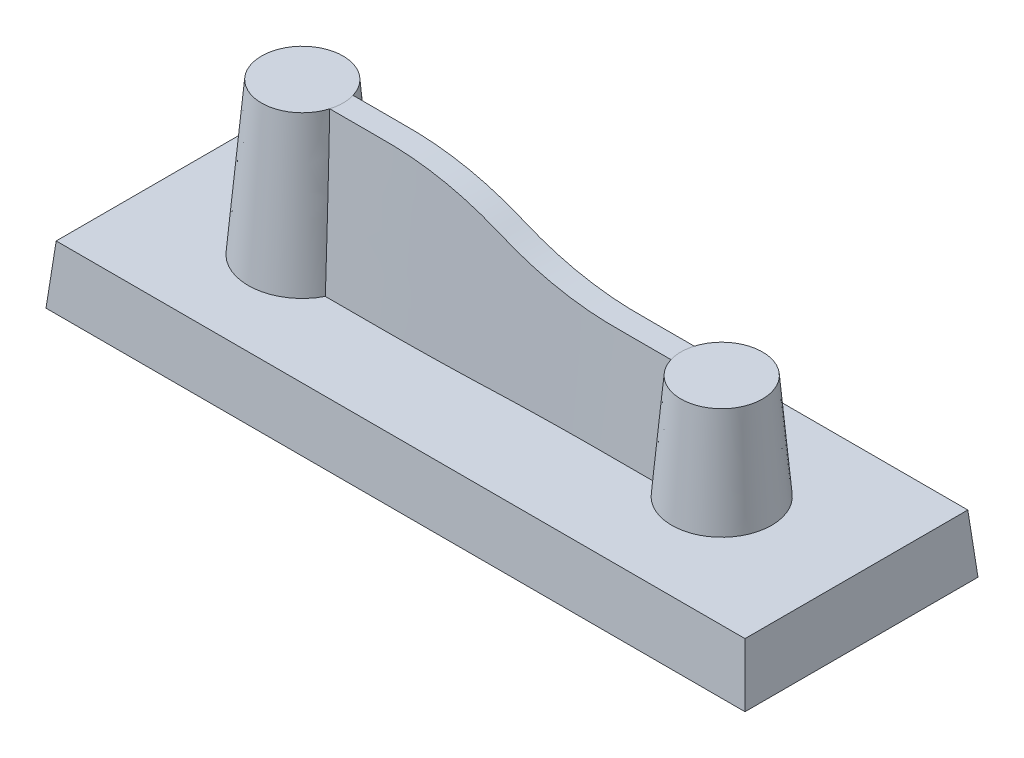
ISO-10303-21;
HEADER;
FILE_DESCRIPTION(('STEP AP214'),'2;1');
FILE_NAME('part.step','',(''),(''),'','','');
FILE_SCHEMA(('AUTOMOTIVE_DESIGN { 1 0 10303 214 1 1 1 1 }'));
ENDSEC;
DATA;
#1=APPLICATION_CONTEXT('core data for automotive mechanical design processes');
#2=APPLICATION_PROTOCOL_DEFINITION('international standard','automotive_design',2000,#1);
#3=PRODUCT_CONTEXT('',#1,'mechanical');
#4=PRODUCT('Part','Part','',(#3));
#5=PRODUCT_RELATED_PRODUCT_CATEGORY('part','',(#4));
#6=PRODUCT_DEFINITION_FORMATION('','',#4);
#7=PRODUCT_DEFINITION_CONTEXT('part definition',#1,'design');
#8=PRODUCT_DEFINITION('design','',#6,#7);
#9=PRODUCT_DEFINITION_SHAPE('','',#8);
#10=(LENGTH_UNIT() NAMED_UNIT(*) SI_UNIT(.MILLI.,.METRE.));
#11=(NAMED_UNIT(*) PLANE_ANGLE_UNIT() SI_UNIT($,.RADIAN.));
#12=(NAMED_UNIT(*) SI_UNIT($,.STERADIAN.) SOLID_ANGLE_UNIT());
#13=UNCERTAINTY_MEASURE_WITH_UNIT(LENGTH_MEASURE(1.E-05),#10,'distance_accuracy_value','');
#14=(GEOMETRIC_REPRESENTATION_CONTEXT(3) GLOBAL_UNCERTAINTY_ASSIGNED_CONTEXT((#13)) GLOBAL_UNIT_ASSIGNED_CONTEXT((#10,
#11,#12)) REPRESENTATION_CONTEXT('',''));
#15=CARTESIAN_POINT('',(0.,0.,0.));
#16=DIRECTION('',(0.,0.,1.));
#17=DIRECTION('',(1.,0.,0.));
#18=AXIS2_PLACEMENT_3D('',#15,#16,#17);
#19=CARTESIAN_POINT('',(150.,0.,-50.));
#20=DIRECTION('',(0.996194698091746,0.0871557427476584,0.));
#21=DIRECTION('',(-0.0871557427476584,0.996194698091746,0.));
#22=AXIS2_PLACEMENT_3D('',#19,#20,#21);
#23=PLANE('',#22);
#24=DIRECTION('',(0.,0.,-1.));
#25=VECTOR('',#24,1.);
#26=CARTESIAN_POINT('',(150.,0.,-50.));
#27=LINE('',#26,#25);
#28=CARTESIAN_POINT('',(150.,0.,50.));
#29=VERTEX_POINT('',#28);
#30=CARTESIAN_POINT('',(150.,0.,-50.));
#31=VERTEX_POINT('',#30);
#32=EDGE_CURVE('E269',#29,#31,#27,.T.);
#33=ORIENTED_EDGE('',*,*,#32,.T.);
#34=DIRECTION('',(0.0868265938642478,-0.992432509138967,-0.0868265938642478));
#35=VECTOR('',#34,1.);
#36=CARTESIAN_POINT('',(147.73834277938,25.8508603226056,-47.7383427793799));
#37=LINE('',#36,#35);
#38=CARTESIAN_POINT('',(147.812783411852,25.,-47.8127834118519));
#39=VERTEX_POINT('',#38);
#40=EDGE_CURVE('E277',#39,#31,#37,.T.);
#41=ORIENTED_EDGE('',*,*,#40,.F.);
#42=DIRECTION('',(0.,0.,1.));
#43=VECTOR('',#42,1.);
#44=CARTESIAN_POINT('',(147.812783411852,25.,-50.));
#45=LINE('',#44,#43);
#46=CARTESIAN_POINT('',(147.812783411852,25.,47.8127834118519));
#47=VERTEX_POINT('',#46);
#48=EDGE_CURVE('E270',#47,#39,#45,.F.);
#49=ORIENTED_EDGE('',*,*,#48,.F.);
#50=DIRECTION('',(0.0868265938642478,-0.992432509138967,0.0868265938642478));
#51=VECTOR('',#50,1.);
#52=CARTESIAN_POINT('',(149.246114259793,8.61695344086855,49.2461142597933));
#53=LINE('',#52,#51);
#54=EDGE_CURVE('E266',#47,#29,#53,.T.);
#55=ORIENTED_EDGE('',*,*,#54,.T.);
#56=EDGE_LOOP('',(#33,#41,#49,#55));
#57=FACE_BOUND('',#56,.T.);
#58=ADVANCED_FACE('F32',(#57),#23,.T.);
#59=CARTESIAN_POINT('',(-150.,0.,-50.));
#60=DIRECTION('',(0.,0.0871557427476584,-0.996194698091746));
#61=DIRECTION('',(0.,0.996194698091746,0.0871557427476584));
#62=AXIS2_PLACEMENT_3D('',#59,#60,#61);
#63=PLANE('',#62);
#64=DIRECTION('',(-1.,0.,0.));
#65=VECTOR('',#64,1.);
#66=CARTESIAN_POINT('',(-150.,0.,-50.));
#67=LINE('',#66,#65);
#68=CARTESIAN_POINT('',(-150.,0.,-50.));
#69=VERTEX_POINT('',#68);
#70=EDGE_CURVE('E261',#31,#69,#67,.T.);
#71=ORIENTED_EDGE('',*,*,#70,.T.);
#72=DIRECTION('',(-0.0868265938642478,-0.992432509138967,-0.0868265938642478));
#73=VECTOR('',#72,1.);
#74=CARTESIAN_POINT('',(-150.,0.,-50.));
#75=LINE('',#74,#73);
#76=CARTESIAN_POINT('',(-147.812783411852,25.,-47.8127834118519));
#77=VERTEX_POINT('',#76);
#78=EDGE_CURVE('E257',#77,#69,#75,.T.);
#79=ORIENTED_EDGE('',*,*,#78,.F.);
#80=DIRECTION('',(1.,0.,0.));
#81=VECTOR('',#80,1.);
#82=CARTESIAN_POINT('',(-150.,25.,-47.8127834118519));
#83=LINE('',#82,#81);
#84=EDGE_CURVE('E273',#39,#77,#83,.F.);
#85=ORIENTED_EDGE('',*,*,#84,.F.);
#86=ORIENTED_EDGE('',*,*,#40,.T.);
#87=EDGE_LOOP('',(#71,#79,#85,#86));
#88=FACE_BOUND('',#87,.T.);
#89=ADVANCED_FACE('F34',(#88),#63,.T.);
#90=CARTESIAN_POINT('',(-150.,0.,-50.));
#91=DIRECTION('',(-0.996194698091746,0.0871557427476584,0.));
#92=DIRECTION('',(-0.0871557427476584,-0.996194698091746,0.));
#93=AXIS2_PLACEMENT_3D('',#90,#91,#92);
#94=PLANE('',#93);
#95=DIRECTION('',(0.,0.,1.));
#96=VECTOR('',#95,1.);
#97=CARTESIAN_POINT('',(-150.,0.,-50.));
#98=LINE('',#97,#96);
#99=CARTESIAN_POINT('',(-150.,0.,50.));
#100=VERTEX_POINT('',#99);
#101=EDGE_CURVE('E251',#69,#100,#98,.T.);
#102=ORIENTED_EDGE('',*,*,#101,.T.);
#103=DIRECTION('',(-0.0868265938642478,-0.992432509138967,0.0868265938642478));
#104=VECTOR('',#103,1.);
#105=CARTESIAN_POINT('',(-150.,0.,50.));
#106=LINE('',#105,#104);
#107=CARTESIAN_POINT('',(-147.812783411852,25.,47.8127834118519));
#108=VERTEX_POINT('',#107);
#109=EDGE_CURVE('E254',#108,#100,#106,.T.);
#110=ORIENTED_EDGE('',*,*,#109,.F.);
#111=DIRECTION('',(0.,0.,-1.));
#112=VECTOR('',#111,1.);
#113=CARTESIAN_POINT('',(-147.812783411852,25.,-50.));
#114=LINE('',#113,#112);
#115=EDGE_CURVE('E283',#77,#108,#114,.F.);
#116=ORIENTED_EDGE('',*,*,#115,.F.);
#117=ORIENTED_EDGE('',*,*,#78,.T.);
#118=EDGE_LOOP('',(#102,#110,#116,#117));
#119=FACE_BOUND('',#118,.T.);
#120=ADVANCED_FACE('F237',(#119),#94,.T.);
#121=CARTESIAN_POINT('',(-150.,0.,50.));
#122=DIRECTION('',(0.,0.0871557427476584,0.996194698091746));
#123=DIRECTION('',(0.,-0.996194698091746,0.0871557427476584));
#124=AXIS2_PLACEMENT_3D('',#121,#122,#123);
#125=PLANE('',#124);
#126=DIRECTION('',(1.,0.,0.));
#127=VECTOR('',#126,1.);
#128=CARTESIAN_POINT('',(-150.,0.,50.));
#129=LINE('',#128,#127);
#130=EDGE_CURVE('E260',#100,#29,#129,.T.);
#131=ORIENTED_EDGE('',*,*,#130,.T.);
#132=ORIENTED_EDGE('',*,*,#54,.F.);
#133=DIRECTION('',(-1.,0.,0.));
#134=VECTOR('',#133,1.);
#135=CARTESIAN_POINT('',(-150.,25.,47.8127834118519));
#136=LINE('',#135,#134);
#137=EDGE_CURVE('E265',#108,#47,#136,.F.);
#138=ORIENTED_EDGE('',*,*,#137,.F.);
#139=ORIENTED_EDGE('',*,*,#109,.T.);
#140=EDGE_LOOP('',(#131,#132,#138,#139));
#141=FACE_BOUND('',#140,.T.);
#142=ADVANCED_FACE('F241',(#141),#125,.T.);
#143=CARTESIAN_POINT('',(0.,25.,0.));
#144=DIRECTION('',(0.,1.,0.));
#145=DIRECTION('',(0.,0.,1.));
#146=AXIS2_PLACEMENT_3D('',#143,#144,#145);
#147=PLANE('',#146);
#148=CARTESIAN_POINT('',(-90.,25.,-10.6867631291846));
#149=CARTESIAN_POINT('',(-82.3982130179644,25.,-10.6867631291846));
#150=CARTESIAN_POINT('',(-74.7964260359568,25.,-10.6867631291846));
#151=CARTESIAN_POINT('',(-63.3937455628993,25.,-10.6867631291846));
#152=CARTESIAN_POINT('',(-59.5928520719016,25.,-10.6867631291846));
#153=CARTESIAN_POINT('',(-53.8915118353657,25.,-10.6867631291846));
#154=CARTESIAN_POINT('',(-51.9910651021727,25.0000012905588,-10.6867631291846));
#155=CARTESIAN_POINT('',(-48.1901715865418,24.9999987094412,-10.6867631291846));
#156=CARTESIAN_POINT('',(-46.2895846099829,24.9852856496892,-10.6867631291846));
#157=CARTESIAN_POINT('',(-36.7920527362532,24.6355662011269,-10.6867631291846));
#158=CARTESIAN_POINT('',(-29.170334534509,23.6548941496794,-10.6867631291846));
#159=CARTESIAN_POINT('',(-17.9889124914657,21.1549886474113,-10.6867631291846));
#160=CARTESIAN_POINT('',(-14.3036206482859,20.1513190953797,-10.6867631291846));
#161=CARTESIAN_POINT('',(-8.87221045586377,18.402689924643,-10.6867631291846));
#162=CARTESIAN_POINT('',(-7.07728970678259,17.7797307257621,-10.6867631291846));
#163=CARTESIAN_POINT('',(-3.51693470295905,16.4477533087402,-10.6867631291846));
#164=CARTESIAN_POINT('',(-1.75687032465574,15.7278432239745,-10.6867631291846));
#165=CARTESIAN_POINT('',(1.75687032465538,14.2721567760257,-10.6867631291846));
#166=CARTESIAN_POINT('',(3.51693470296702,13.5522466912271,-10.6867631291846));
#167=CARTESIAN_POINT('',(7.07728970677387,12.2202692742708,-10.6867631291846));
#168=CARTESIAN_POINT('',(8.87221045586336,11.5973100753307,-10.6867631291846));
#169=CARTESIAN_POINT('',(14.3036206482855,9.84868090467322,-10.6867631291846));
#170=CARTESIAN_POINT('',(17.9889124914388,8.84501135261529,-10.6867631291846));
#171=CARTESIAN_POINT('',(29.1703345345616,6.34510585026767,-10.6867631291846));
#172=CARTESIAN_POINT('',(36.7920527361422,5.36443379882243,-10.6867631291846));
#173=CARTESIAN_POINT('',(46.28958461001,5.01471435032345,-10.6867631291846));
#174=CARTESIAN_POINT('',(48.1901715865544,5.00000129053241,-10.6867631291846));
#175=CARTESIAN_POINT('',(51.991065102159,4.9999987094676,-10.6867631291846));
#176=CARTESIAN_POINT('',(53.8915118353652,5.,-10.6867631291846));
#177=CARTESIAN_POINT('',(59.5928520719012,5.,-10.6867631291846));
#178=CARTESIAN_POINT('',(63.3937455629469,5.,-10.6867631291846));
#179=CARTESIAN_POINT('',(74.7964260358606,5.,-10.6867631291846));
#180=CARTESIAN_POINT('',(82.3982130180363,5.,-10.6867631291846));
#181=CARTESIAN_POINT('',(90.,5.,-10.6867631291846));
#182=B_SPLINE_CURVE_WITH_KNOTS('',3,(#148,#149,#150,#151,#152,#153,#154,#155,#156,#157,#158,
#159,#160,#161,#162,#163,#164,#165,#166,#167,#168,#169,#170,#171,#172,#173,#174,#175,#176,#177,
#178,#179,#180,#181),.UNSPECIFIED.,.F.,.F.,(4,2,2,2,2,2,2,2,2,2,2,2,2,2,2,2,4),(0.,0.125,0.1875,
0.21875,0.25,0.375,0.4375,0.46875,0.5,0.53125,0.5625,0.625,0.75,0.78125,0.8125,0.875,1.),.UNSPECIFIED.);
#183=CARTESIAN_POINT('',(-69.4228505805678,25.,-10.6867631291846));
#184=VERTEX_POINT('',#183);
#185=CARTESIAN_POINT('',(-50.0906183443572,25.,-10.6867631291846));
#186=VERTEX_POINT('',#185);
#187=EDGE_CURVE('E55',#184,#186,#182,.T.);
#188=ORIENTED_EDGE('',*,*,#187,.T.);
#189=CARTESIAN_POINT('',(90.,25.,-8.93698985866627));
#190=CARTESIAN_POINT('',(88.1875759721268,25.,-8.9369898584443));
#191=CARTESIAN_POINT('',(86.3751519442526,25.,-8.93698985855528));
#192=CARTESIAN_POINT('',(82.7501462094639,25.,-8.93698985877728));
#193=CARTESIAN_POINT('',(80.9375645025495,25.,-8.93698985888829));
#194=CARTESIAN_POINT('',(77.3122761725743,25.,-8.93698985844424));
#195=CARTESIAN_POINT('',(75.4995695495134,25.,-8.93698985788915));
#196=CARTESIAN_POINT('',(71.8740641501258,25.,-8.93698985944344));
#197=CARTESIAN_POINT('',(70.0612653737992,25.,-8.93698986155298));
#198=CARTESIAN_POINT('',(66.4356084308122,25.,-8.93698985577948));
#199=CARTESIAN_POINT('',(64.6227502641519,25.,-8.93698984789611));
#200=CARTESIAN_POINT('',(61.9034496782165,25.,-8.93698986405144));
#201=CARTESIAN_POINT('',(60.9970072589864,25.,-8.93698987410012));
#202=CARTESIAN_POINT('',(59.1841224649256,25.,-8.93698984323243));
#203=CARTESIAN_POINT('',(58.2776800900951,25.,-8.93698980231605));
#204=CARTESIAN_POINT('',(56.4650426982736,25.,-8.93698991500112));
#205=CARTESIAN_POINT('',(55.5588476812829,25.,-8.93699006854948));
#206=CARTESIAN_POINT('',(53.746457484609,25.,-8.93698962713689));
#207=CARTESIAN_POINT('',(52.8402623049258,25.,-8.93698903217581));
#208=CARTESIAN_POINT('',(51.4809749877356,25.,-8.93699019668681));
#209=CARTESIAN_POINT('',(51.0278828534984,25.,-8.93699092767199));
#210=CARTESIAN_POINT('',(50.1216985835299,25.,-8.93698874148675));
#211=CARTESIAN_POINT('',(49.6686064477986,25.,-8.93698582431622));
#212=CARTESIAN_POINT('',(48.3093303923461,25.,-8.93730944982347));
#213=CARTESIAN_POINT('',(47.4031464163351,25.,-8.93796836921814));
#214=CARTESIAN_POINT('',(46.0438883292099,25.,-8.94013401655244));
#215=CARTESIAN_POINT('',(45.5908133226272,25.,-8.94105208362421));
#216=CARTESIAN_POINT('',(44.6846646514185,25.,-8.94340703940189));
#217=CARTESIAN_POINT('',(44.2315909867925,25.,-8.94484392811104));
#218=CARTESIAN_POINT('',(42.8723721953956,25.,-8.94980875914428));
#219=CARTESIAN_POINT('',(41.966229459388,25.,-8.95399086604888));
#220=CARTESIAN_POINT('',(39.247885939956,25.,-8.96914104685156));
#221=CARTESIAN_POINT('',(37.435699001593,25.,-8.98271310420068));
#222=CARTESIAN_POINT('',(33.811456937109,25.,-9.01684146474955));
#223=CARTESIAN_POINT('',(31.9994018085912,25.,-9.03739751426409));
#224=CARTESIAN_POINT('',(28.3754473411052,25.,-9.08560669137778));
#225=CARTESIAN_POINT('',(26.5635479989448,25.,-9.11325957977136));
#226=CARTESIAN_POINT('',(22.3611755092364,25.,-9.18589004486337));
#227=CARTESIAN_POINT('',(19.9707482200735,25.,-9.23358008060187));
#228=CARTESIAN_POINT('',(16.3853045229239,25.,-9.31501592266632));
#229=CARTESIAN_POINT('',(15.1901735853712,25.,-9.34381178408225));
#230=CARTESIAN_POINT('',(12.7999973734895,25.,-9.40479346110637));
#231=CARTESIAN_POINT('',(11.6049520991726,25.,-9.43697927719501));
#232=CARTESIAN_POINT('',(9.81243427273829,25.,-9.48785545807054));
#233=CARTESIAN_POINT('',(9.21492458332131,25.,-9.50524747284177));
#234=CARTESIAN_POINT('',(8.01993214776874,25.,-9.54093529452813));
#235=CARTESIAN_POINT('',(7.42244940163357,25.,-9.55923110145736));
#236=CARTESIAN_POINT('',(6.22751212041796,25.,-9.59671359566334));
#237=CARTESIAN_POINT('',(5.63005758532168,25.,-9.61590028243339));
#238=CARTESIAN_POINT('',(4.43518549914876,25.,-9.65538779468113));
#239=CARTESIAN_POINT('',(3.83776794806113,25.,-9.67568861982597));
#240=CARTESIAN_POINT('',(2.64293835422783,25.,-9.71713822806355));
#241=CARTESIAN_POINT('',(2.04552631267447,25.,-9.73828704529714));
#242=CARTESIAN_POINT('',(1.14942064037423,25.,-9.77035871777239));
#243=CARTESIAN_POINT('',(0.850720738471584,25.,-9.781107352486));
#244=CARTESIAN_POINT('',(0.253324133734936,25.,-9.80269328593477));
#245=CARTESIAN_POINT('',(-0.045372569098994,25.,-9.81353058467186));
#246=CARTESIAN_POINT('',(-0.941465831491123,25.,-9.84594603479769));
#247=CARTESIAN_POINT('',(-1.53886589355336,25.,-9.86742775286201));
#248=CARTESIAN_POINT('',(-2.73368774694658,25.,-9.90977319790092));
#249=CARTESIAN_POINT('',(-3.33110953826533,25.,-9.93063692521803));
#250=CARTESIAN_POINT('',(-4.22725851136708,25.,-9.96121684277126));
#251=CARTESIAN_POINT('',(-4.52597347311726,25.,-9.97129073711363));
#252=CARTESIAN_POINT('',(-5.12341307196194,25.,-9.99114743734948));
#253=CARTESIAN_POINT('',(-5.42213770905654,25.,-10.0009302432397));
#254=CARTESIAN_POINT('',(-6.31832318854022,25.,-10.0299236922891));
#255=CARTESIAN_POINT('',(-6.9157955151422,25.,-10.0487793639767));
#256=CARTESIAN_POINT('',(-8.70825645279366,25.,-10.1039785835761));
#257=CARTESIAN_POINT('',(-9.90328739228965,25.,-10.1389542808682));
#258=CARTESIAN_POINT('',(-12.2933992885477,25.,-10.2054578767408));
#259=CARTESIAN_POINT('',(-13.4884802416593,25.,-10.2369859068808));
#260=CARTESIAN_POINT('',(-15.8787251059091,25.,-10.2966713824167));
#261=CARTESIAN_POINT('',(-17.0738890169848,25.,-10.3248288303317));
#262=CARTESIAN_POINT('',(-20.6594302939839,25.,-10.4043642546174));
#263=CARTESIAN_POINT('',(-23.0499187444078,25.,-10.4508070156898));
#264=CARTESIAN_POINT('',(-27.8310650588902,25.,-10.5310045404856));
#265=CARTESIAN_POINT('',(-30.221722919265,25.,-10.5647595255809));
#266=CARTESIAN_POINT('',(-34.2061854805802,25.,-10.6108203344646));
#267=CARTESIAN_POINT('',(-35.7999515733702,25.,-10.6265252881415));
#268=CARTESIAN_POINT('',(-38.1906432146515,25.,-10.646038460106));
#269=CARTESIAN_POINT('',(-38.98755259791,25.,-10.651868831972));
#270=CARTESIAN_POINT('',(-40.581380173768,25.,-10.6621881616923));
#271=CARTESIAN_POINT('',(-41.3782983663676,25.,-10.6666771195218));
#272=CARTESIAN_POINT('',(-42.5736876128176,25.,-10.6723934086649));
#273=CARTESIAN_POINT('',(-42.9721563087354,25.,-10.6741293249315));
#274=CARTESIAN_POINT('',(-43.7690949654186,25.,-10.6772805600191));
#275=CARTESIAN_POINT('',(-44.1675649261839,25.,-10.6786958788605));
#276=CARTESIAN_POINT('',(-45.362976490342,25.,-10.6823370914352));
#277=CARTESIAN_POINT('',(-46.1599199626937,25.,-10.6839582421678));
#278=CARTESIAN_POINT('',(-47.7538246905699,25.,-10.6860569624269));
#279=CARTESIAN_POINT('',(-48.5507859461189,25.,-10.6865345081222));
#280=CARTESIAN_POINT('',(-49.7462279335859,25.,-10.6867672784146));
#281=CARTESIAN_POINT('',(-50.1447086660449,25.,-10.6867642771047));
#282=CARTESIAN_POINT('',(-50.9416701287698,25.,-10.6867620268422));
#283=CARTESIAN_POINT('',(-51.3401508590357,25.,-10.6867627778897));
#284=CARTESIAN_POINT('',(-52.5356026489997,25.,-10.6867639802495));
#285=CARTESIAN_POINT('',(-53.3325737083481,25.,-10.6867633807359));
#286=CARTESIAN_POINT('',(-54.9265157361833,25.,-10.6867629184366));
#287=CARTESIAN_POINT('',(-55.7234867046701,25.,-10.6867630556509));
#288=CARTESIAN_POINT('',(-58.1144077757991,25.,-10.6867632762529));
#289=CARTESIAN_POINT('',(-59.708357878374,25.,-10.6867631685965));
#290=CARTESIAN_POINT('',(-62.8966947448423,25.,-10.6867630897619));
#291=CARTESIAN_POINT('',(-64.4910815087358,25.,-10.6867631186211));
#292=CARTESIAN_POINT('',(-67.6798437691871,25.,-10.686763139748));
#293=CARTESIAN_POINT('',(-69.2742192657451,25.,-10.686763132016));
#294=CARTESIAN_POINT('',(-72.4629462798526,25.,-10.6867631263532));
#295=CARTESIAN_POINT('',(-74.0572977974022,25.,-10.6867631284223));
#296=CARTESIAN_POINT('',(-77.2459641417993,25.,-10.6867631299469));
#297=CARTESIAN_POINT('',(-78.8402789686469,25.,-10.6867631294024));
#298=CARTESIAN_POINT('',(-82.0288592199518,25.,-10.6867631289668));
#299=CARTESIAN_POINT('',(-83.6231246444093,25.,-10.6867631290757));
#300=CARTESIAN_POINT('',(-86.8115933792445,25.,-10.6867631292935));
#301=CARTESIAN_POINT('',(-88.4057966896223,25.,-10.6867631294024));
#302=CARTESIAN_POINT('',(-90.,25.,-10.6867631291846));
#303=B_SPLINE_CURVE_WITH_KNOTS('',3,(#189,#190,#191,#192,#193,#194,#195,#196,#197,#198,#199,
#200,#201,#202,#203,#204,#205,#206,#207,#208,#209,#210,#211,#212,#213,#214,#215,#216,#217,#218,
#219,#220,#221,#222,#223,#224,#225,#226,#227,#228,#229,#230,#231,#232,#233,#234,#235,#236,#237,
#238,#239,#240,#241,#242,#243,#244,#245,#246,#247,#248,#249,#250,#251,#252,#253,#254,#255,#256,
#257,#258,#259,#260,#261,#262,#263,#264,#265,#266,#267,#268,#269,#270,#271,#272,#273,#274,#275,
#276,#277,#278,#279,#280,#281,#282,#283,#284,#285,#286,#287,#288,#289,#290,#291,#292,#293,#294,
#295,#296,#297,#298,#299,#300,#301,#302),.UNSPECIFIED.,.F.,.F.,(4,2,2,2,2,2,2,2,2,2,2,2,2,2,2,2,
2,2,2,2,2,2,2,2,2,2,2,2,2,2,2,2,2,2,2,2,2,2,2,2,2,2,2,2,2,2,2,2,2,2,2,2,2,2,2,2,4),(0.,
5.43727208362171,10.8750172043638,16.3131370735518,21.7515334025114,27.1901079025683,
29.9094351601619,32.6287622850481,35.3473473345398,38.0659328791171,39.4252092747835,
40.7844857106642,43.5030373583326,44.8622649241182,46.2214924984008,48.9399482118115,
54.3766471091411,59.8131485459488,65.2494667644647,72.4221352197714,76.0085649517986,
79.5949951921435,81.3882829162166,83.1815706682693,84.9748574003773,86.7681435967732,
88.5615020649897,89.4581817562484,90.3548614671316,92.1482198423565,93.9415772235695,
94.838231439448,95.7348856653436,97.5281943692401,101.114816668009,104.701302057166,
108.287784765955,115.460565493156,122.63322106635,127.41474236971,129.805533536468,
132.196324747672,133.391742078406,134.587159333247,136.977993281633,139.368877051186,
140.564319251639,141.759761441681,144.150674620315,146.541587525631,151.323437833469,
156.106598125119,160.889724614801,165.672779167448,170.455723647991,175.238519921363,
180.021129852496),.UNSPECIFIED.);
#304=CARTESIAN_POINT('',(70.5147556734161,25.,-8.93698985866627));
#305=VERTEX_POINT('',#304);
#306=EDGE_CURVE('E209',#305,#186,#303,.T.);
#307=ORIENTED_EDGE('',*,*,#306,.F.);
#308=CARTESIAN_POINT('',(90.,25.,0.));
#309=DIRECTION('',(0.,1.,0.));
#310=DIRECTION('',(0.,0.,1.));
#311=AXIS2_PLACEMENT_3D('',#308,#309,#310);
#312=CIRCLE('',#311,21.4369898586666);
#313=CARTESIAN_POINT('',(70.5147556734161,25.,8.93698985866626));
#314=VERTEX_POINT('',#313);
#315=EDGE_CURVE('E11',#314,#305,#312,.T.);
#316=ORIENTED_EDGE('',*,*,#315,.F.);
#317=CARTESIAN_POINT('',(-90.,25.,10.6867631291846));
#318=CARTESIAN_POINT('',(-88.1875759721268,25.,10.6867631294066));
#319=CARTESIAN_POINT('',(-86.3751519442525,25.,10.6867631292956));
#320=CARTESIAN_POINT('',(-82.7501462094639,25.,10.6867631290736));
#321=CARTESIAN_POINT('',(-80.9375645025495,25.,10.6867631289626));
#322=CARTESIAN_POINT('',(-77.3122761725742,25.,10.6867631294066));
#323=CARTESIAN_POINT('',(-75.4995695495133,25.,10.6867631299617));
#324=CARTESIAN_POINT('',(-71.8740641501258,25.,10.6867631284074));
#325=CARTESIAN_POINT('',(-70.0612653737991,25.,10.6867631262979));
#326=CARTESIAN_POINT('',(-66.4356084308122,25.,10.6867631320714));
#327=CARTESIAN_POINT('',(-64.6227502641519,25.,10.6867631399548));
#328=CARTESIAN_POINT('',(-61.9034496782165,25.,10.6867631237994));
#329=CARTESIAN_POINT('',(-60.9970072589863,25.,10.6867631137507));
#330=CARTESIAN_POINT('',(-59.1841224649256,25.,10.6867631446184));
#331=CARTESIAN_POINT('',(-58.277680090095,25.,10.6867631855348));
#332=CARTESIAN_POINT('',(-56.4650426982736,25.,10.6867630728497));
#333=CARTESIAN_POINT('',(-55.5588476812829,25.,10.6867629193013));
#334=CARTESIAN_POINT('',(-53.7464574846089,25.,10.6867633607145));
#335=CARTESIAN_POINT('',(-52.8402623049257,25.,10.6867639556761));
#336=CARTESIAN_POINT('',(-51.4809749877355,25.,10.6867627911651));
#337=CARTESIAN_POINT('',(-51.0278828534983,25.,10.6867620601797));
#338=CARTESIAN_POINT('',(-50.1216985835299,25.,10.6867642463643));
#339=CARTESIAN_POINT('',(-49.6686064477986,25.,10.6867671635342));
#340=CARTESIAN_POINT('',(-48.309330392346,25.,10.6864435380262));
#341=CARTESIAN_POINT('',(-47.4031464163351,25.,10.6857846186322));
#342=CARTESIAN_POINT('',(-46.0438883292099,25.,10.6836189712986));
#343=CARTESIAN_POINT('',(-45.5908133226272,25.,10.682700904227));
#344=CARTESIAN_POINT('',(-44.6846646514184,25.,10.6803459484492));
#345=CARTESIAN_POINT('',(-44.2315909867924,25.,10.6789090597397));
#346=CARTESIAN_POINT('',(-42.8723721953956,25.,10.6739442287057));
#347=CARTESIAN_POINT('',(-41.966229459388,25.,10.6697621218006));
#348=CARTESIAN_POINT('',(-39.247885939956,25.,10.6546119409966));
#349=CARTESIAN_POINT('',(-37.435699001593,25.,10.6410398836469));
#350=CARTESIAN_POINT('',(-33.811456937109,25.,10.6069115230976));
#351=CARTESIAN_POINT('',(-31.9994018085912,25.,10.5863554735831));
#352=CARTESIAN_POINT('',(-28.3754473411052,25.,10.5381462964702));
#353=CARTESIAN_POINT('',(-26.5635479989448,25.,10.5104934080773));
#354=CARTESIAN_POINT('',(-22.3611755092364,25.,10.4378629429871));
#355=CARTESIAN_POINT('',(-19.9707482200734,25.,10.3901729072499));
#356=CARTESIAN_POINT('',(-16.3853045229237,25.,10.308737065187));
#357=CARTESIAN_POINT('',(-15.190173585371,25.,10.2799412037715));
#358=CARTESIAN_POINT('',(-12.7999973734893,25.,10.2189595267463));
#359=CARTESIAN_POINT('',(-11.6049520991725,25.,10.1867737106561));
#360=CARTESIAN_POINT('',(-9.81243427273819,25.,10.1358975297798));
#361=CARTESIAN_POINT('',(-9.2149245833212,25.,10.1185055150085));
#362=CARTESIAN_POINT('',(-8.01993214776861,25.,10.0828176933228));
#363=CARTESIAN_POINT('',(-7.42244940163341,25.,10.0645218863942));
#364=CARTESIAN_POINT('',(-6.2275121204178,25.,10.0270393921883));
#365=CARTESIAN_POINT('',(-5.63005758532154,25.,10.0078527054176));
#366=CARTESIAN_POINT('',(-4.43518549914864,25.,9.96836519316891));
#367=CARTESIAN_POINT('',(-3.83776794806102,25.,9.94806436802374));
#368=CARTESIAN_POINT('',(-2.6429383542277,25.,9.90661475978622));
#369=CARTESIAN_POINT('',(-2.04552631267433,25.,9.88546594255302));
#370=CARTESIAN_POINT('',(-1.14942064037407,25.,9.8533942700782));
#371=CARTESIAN_POINT('',(-0.850720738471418,25.,9.84264563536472));
#372=CARTESIAN_POINT('',(-0.253324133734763,25.,9.8210597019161));
#373=CARTESIAN_POINT('',(0.0453725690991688,25.,9.81022240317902));
#374=CARTESIAN_POINT('',(0.941465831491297,25.,9.77780695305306));
#375=CARTESIAN_POINT('',(1.53886589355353,25.,9.75632523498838));
#376=CARTESIAN_POINT('',(2.73368774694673,25.,9.71397978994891));
#377=CARTESIAN_POINT('',(3.33110953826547,25.,9.6931160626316));
#378=CARTESIAN_POINT('',(4.22725851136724,25.,9.66253614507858));
#379=CARTESIAN_POINT('',(4.52597347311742,25.,9.65246225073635));
#380=CARTESIAN_POINT('',(5.12341307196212,25.,9.63260555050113));
#381=CARTESIAN_POINT('',(5.42213770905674,25.,9.62282274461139));
#382=CARTESIAN_POINT('',(6.31832318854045,25.,9.59382929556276));
#383=CARTESIAN_POINT('',(6.91579551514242,25.,9.57497362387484));
#384=CARTESIAN_POINT('',(8.70825645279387,25.,9.51977440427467));
#385=CARTESIAN_POINT('',(9.90328739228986,25.,9.48479870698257));
#386=CARTESIAN_POINT('',(12.293399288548,25.,9.41829511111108));
#387=CARTESIAN_POINT('',(13.4884802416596,25.,9.38676708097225));
#388=CARTESIAN_POINT('',(15.8787251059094,25.,9.32708160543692));
#389=CARTESIAN_POINT('',(17.0738890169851,25.,9.29892415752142));
#390=CARTESIAN_POINT('',(20.6594302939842,25.,9.21938873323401));
#391=CARTESIAN_POINT('',(23.049918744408,25.,9.17294597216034));
#392=CARTESIAN_POINT('',(27.8310650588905,25.,9.09274844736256));
#393=CARTESIAN_POINT('',(30.2217229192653,25.,9.05899346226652));
#394=CARTESIAN_POINT('',(34.2061854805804,25.,9.01293265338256));
#395=CARTESIAN_POINT('',(35.7999515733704,25.,8.99722769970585));
#396=CARTESIAN_POINT('',(38.1906432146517,25.,8.9777145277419));
#397=CARTESIAN_POINT('',(38.9875525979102,25.,8.97188415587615));
#398=CARTESIAN_POINT('',(40.5813801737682,25.,8.96156482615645));
#399=CARTESIAN_POINT('',(41.3782983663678,25.,8.95707586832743));
#400=CARTESIAN_POINT('',(42.5736876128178,25.,8.95135957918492));
#401=CARTESIAN_POINT('',(42.9721563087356,25.,8.94962366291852));
#402=CARTESIAN_POINT('',(43.7690949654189,25.,8.94647242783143));
#403=CARTESIAN_POINT('',(44.1675649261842,25.,8.94505710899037));
#404=CARTESIAN_POINT('',(45.3629764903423,25.,8.94141589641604));
#405=CARTESIAN_POINT('',(46.1599199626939,25.,8.93979474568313));
#406=CARTESIAN_POINT('',(47.7538246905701,25.,8.93769602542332));
#407=CARTESIAN_POINT('',(48.5507859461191,25.,8.93721847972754));
#408=CARTESIAN_POINT('',(49.7462279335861,25.,8.9369857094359));
#409=CARTESIAN_POINT('',(50.1447086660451,25.,8.93698871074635));
#410=CARTESIAN_POINT('',(50.94167012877,25.,8.93699096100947));
#411=CARTESIAN_POINT('',(51.3401508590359,25.,8.93699020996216));
#412=CARTESIAN_POINT('',(52.5356026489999,25.,8.93698900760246));
#413=CARTESIAN_POINT('',(53.3325737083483,25.,8.93698960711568));
#414=CARTESIAN_POINT('',(54.9265157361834,25.,8.93699006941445));
#415=CARTESIAN_POINT('',(55.7234867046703,25.,8.93698993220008));
#416=CARTESIAN_POINT('',(58.1144077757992,25.,8.93698971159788));
#417=CARTESIAN_POINT('',(59.7083578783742,25.,8.93698981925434));
#418=CARTESIAN_POINT('',(62.8966947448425,25.,8.93698989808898));
#419=CARTESIAN_POINT('',(64.4910815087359,25.,8.93698986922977));
#420=CARTESIAN_POINT('',(67.6798437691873,25.,8.93698984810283));
#421=CARTESIAN_POINT('',(69.2742192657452,25.,8.93698985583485));
#422=CARTESIAN_POINT('',(72.4629462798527,25.,8.93698986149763));
#423=CARTESIAN_POINT('',(74.0572977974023,25.,8.93698985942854));
#424=CARTESIAN_POINT('',(77.2459641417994,25.,8.93698985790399));
#425=CARTESIAN_POINT('',(78.8402789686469,25.,8.93698985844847));
#426=CARTESIAN_POINT('',(82.0288592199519,25.,8.93698985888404));
#427=CARTESIAN_POINT('',(83.6231246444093,25.,8.93698985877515));
#428=CARTESIAN_POINT('',(86.8115933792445,25.,8.93698985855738));
#429=CARTESIAN_POINT('',(88.4057966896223,25.,8.9369898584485));
#430=CARTESIAN_POINT('',(90.,25.,8.93698985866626));
#431=B_SPLINE_CURVE_WITH_KNOTS('',3,(#317,#318,#319,#320,#321,#322,#323,#324,#325,#326,#327,
#328,#329,#330,#331,#332,#333,#334,#335,#336,#337,#338,#339,#340,#341,#342,#343,#344,#345,#346,
#347,#348,#349,#350,#351,#352,#353,#354,#355,#356,#357,#358,#359,#360,#361,#362,#363,#364,#365,
#366,#367,#368,#369,#370,#371,#372,#373,#374,#375,#376,#377,#378,#379,#380,#381,#382,#383,#384,
#385,#386,#387,#388,#389,#390,#391,#392,#393,#394,#395,#396,#397,#398,#399,#400,#401,#402,#403,
#404,#405,#406,#407,#408,#409,#410,#411,#412,#413,#414,#415,#416,#417,#418,#419,#420,#421,#422,
#423,#424,#425,#426,#427,#428,#429,#430),.UNSPECIFIED.,.F.,.F.,(4,2,2,2,2,2,2,2,2,2,2,2,2,2,2,2,
2,2,2,2,2,2,2,2,2,2,2,2,2,2,2,2,2,2,2,2,2,2,2,2,2,2,2,2,2,2,2,2,2,2,2,2,2,2,2,2,4),(0.,
5.43727208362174,10.8750172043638,16.3131370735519,21.7515334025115,27.1901079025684,
29.909435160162,32.6287622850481,35.3473473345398,38.0659328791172,39.4252092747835,
40.7844857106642,43.5030373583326,44.8622649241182,46.2214924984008,48.9399482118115,
54.3766471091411,59.8131485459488,65.2494667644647,72.4221352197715,76.0085649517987,
79.5949951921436,81.3882829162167,83.1815706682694,84.9748574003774,86.7681435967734,
88.5615020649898,89.4581817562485,90.3548614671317,92.1482198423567,93.9415772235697,
94.8382314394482,95.7348856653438,97.5281943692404,101.114816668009,104.701302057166,
108.287784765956,115.460565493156,122.63322106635,127.414742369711,129.805533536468,
132.196324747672,133.391742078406,134.587159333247,136.977993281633,139.368877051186,
140.564319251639,141.759761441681,144.150674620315,146.541587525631,151.323437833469,
156.106598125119,160.889724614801,165.672779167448,170.455723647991,175.238519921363,
180.021129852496),.UNSPECIFIED.);
#432=CARTESIAN_POINT('',(-50.0906183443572,25.,10.6867631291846));
#433=VERTEX_POINT('',#432);
#434=EDGE_CURVE('E48',#433,#314,#431,.T.);
#435=ORIENTED_EDGE('',*,*,#434,.F.);
#436=CARTESIAN_POINT('',(-90.,25.,10.6867631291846));
#437=CARTESIAN_POINT('',(-82.3982130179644,25.,10.6867631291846));
#438=CARTESIAN_POINT('',(-74.7964260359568,25.,10.6867631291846));
#439=CARTESIAN_POINT('',(-63.3937455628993,25.,10.6867631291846));
#440=CARTESIAN_POINT('',(-59.5928520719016,25.,10.6867631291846));
#441=CARTESIAN_POINT('',(-53.8915118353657,25.,10.6867631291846));
#442=CARTESIAN_POINT('',(-51.9910651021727,25.0000012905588,10.6867631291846));
#443=CARTESIAN_POINT('',(-48.1901715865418,24.9999987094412,10.6867631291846));
#444=CARTESIAN_POINT('',(-46.2895846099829,24.9852856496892,10.6867631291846));
#445=CARTESIAN_POINT('',(-36.7920527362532,24.6355662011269,10.6867631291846));
#446=CARTESIAN_POINT('',(-29.170334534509,23.6548941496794,10.6867631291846));
#447=CARTESIAN_POINT('',(-17.9889124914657,21.1549886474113,10.6867631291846));
#448=CARTESIAN_POINT('',(-14.3036206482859,20.1513190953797,10.6867631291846));
#449=CARTESIAN_POINT('',(-8.87221045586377,18.402689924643,10.6867631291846));
#450=CARTESIAN_POINT('',(-7.07728970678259,17.7797307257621,10.6867631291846));
#451=CARTESIAN_POINT('',(-3.51693470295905,16.4477533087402,10.6867631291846));
#452=CARTESIAN_POINT('',(-1.75687032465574,15.7278432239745,10.6867631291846));
#453=CARTESIAN_POINT('',(1.75687032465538,14.2721567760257,10.6867631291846));
#454=CARTESIAN_POINT('',(3.51693470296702,13.5522466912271,10.6867631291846));
#455=CARTESIAN_POINT('',(7.07728970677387,12.2202692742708,10.6867631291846));
#456=CARTESIAN_POINT('',(8.87221045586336,11.5973100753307,10.6867631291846));
#457=CARTESIAN_POINT('',(14.3036206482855,9.84868090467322,10.6867631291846));
#458=CARTESIAN_POINT('',(17.9889124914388,8.84501135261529,10.6867631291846));
#459=CARTESIAN_POINT('',(29.1703345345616,6.34510585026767,10.6867631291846));
#460=CARTESIAN_POINT('',(36.7920527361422,5.36443379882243,10.6867631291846));
#461=CARTESIAN_POINT('',(46.28958461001,5.01471435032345,10.6867631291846));
#462=CARTESIAN_POINT('',(48.1901715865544,5.00000129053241,10.6867631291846));
#463=CARTESIAN_POINT('',(51.991065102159,4.9999987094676,10.6867631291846));
#464=CARTESIAN_POINT('',(53.8915118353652,5.,10.6867631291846));
#465=CARTESIAN_POINT('',(59.5928520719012,5.,10.6867631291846));
#466=CARTESIAN_POINT('',(63.3937455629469,5.,10.6867631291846));
#467=CARTESIAN_POINT('',(74.7964260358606,5.,10.6867631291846));
#468=CARTESIAN_POINT('',(82.3982130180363,5.,10.6867631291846));
#469=CARTESIAN_POINT('',(90.,5.,10.6867631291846));
#470=B_SPLINE_CURVE_WITH_KNOTS('',3,(#436,#437,#438,#439,#440,#441,#442,#443,#444,#445,#446,
#447,#448,#449,#450,#451,#452,#453,#454,#455,#456,#457,#458,#459,#460,#461,#462,#463,#464,#465,
#466,#467,#468,#469),.UNSPECIFIED.,.F.,.F.,(4,2,2,2,2,2,2,2,2,2,2,2,2,2,2,2,4),(0.,0.125,0.1875,
0.21875,0.25,0.375,0.4375,0.46875,0.5,0.53125,0.5625,0.625,0.75,0.78125,0.8125,0.875,1.),.UNSPECIFIED.);
#471=CARTESIAN_POINT('',(-69.4228505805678,25.,10.6867631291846));
#472=VERTEX_POINT('',#471);
#473=EDGE_CURVE('E127',#472,#433,#470,.T.);
#474=ORIENTED_EDGE('',*,*,#473,.F.);
#475=CARTESIAN_POINT('',(-90.,25.,0.));
#476=DIRECTION('',(0.,1.,0.));
#477=DIRECTION('',(0.,0.,1.));
#478=AXIS2_PLACEMENT_3D('',#475,#476,#477);
#479=CIRCLE('',#478,23.1867631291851);
#480=EDGE_CURVE('E36',#184,#472,#479,.T.);
#481=ORIENTED_EDGE('',*,*,#480,.F.);
#482=EDGE_LOOP('',(#188,#307,#316,#435,#474,#481));
#483=FACE_BOUND('',#482,.T.);
#484=ORIENTED_EDGE('',*,*,#48,.T.);
#485=ORIENTED_EDGE('',*,*,#84,.T.);
#486=ORIENTED_EDGE('',*,*,#115,.T.);
#487=ORIENTED_EDGE('',*,*,#137,.T.);
#488=EDGE_LOOP('',(#484,#485,#486,#487));
#489=FACE_BOUND('',#488,.T.);
#490=ADVANCED_FACE('F199',(#483,#489),#147,.T.);
#491=CARTESIAN_POINT('',(0.,0.,0.));
#492=DIRECTION('',(0.,1.,0.));
#493=DIRECTION('',(0.,0.,1.));
#494=AXIS2_PLACEMENT_3D('',#491,#492,#493);
#495=PLANE('',#494);
#496=ORIENTED_EDGE('',*,*,#32,.F.);
#497=ORIENTED_EDGE('',*,*,#130,.F.);
#498=ORIENTED_EDGE('',*,*,#101,.F.);
#499=ORIENTED_EDGE('',*,*,#70,.F.);
#500=EDGE_LOOP('',(#496,#497,#498,#499));
#501=FACE_BOUND('',#500,.T.);
#502=ADVANCED_FACE('F197',(#501),#495,.F.);
#503=CARTESIAN_POINT('',(-90.,90.,0.));
#504=DIRECTION('',(0.,-1.,0.));
#505=DIRECTION('',(0.,0.,1.));
#506=AXIS2_PLACEMENT_3D('',#503,#504,#505);
#507=CONICAL_SURFACE('',#506,17.5,0.0872664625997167);
#508=CARTESIAN_POINT('',(-69.4228505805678,25.,-10.6867631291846));
#509=CARTESIAN_POINT('',(-69.6107989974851,28.5361748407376,-10.3773879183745));
#510=CARTESIAN_POINT('',(-69.8012912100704,32.0722163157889,-10.06802437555));
#511=CARTESIAN_POINT('',(-70.1878679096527,39.1440010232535,-9.44932338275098));
#512=CARTESIAN_POINT('',(-70.3839524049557,42.6797442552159,-9.13998593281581));
#513=CARTESIAN_POINT('',(-70.7886384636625,49.8648884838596,-8.51136726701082));
#514=CARTESIAN_POINT('',(-70.9974397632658,53.5142783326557,-8.19208702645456));
#515=CARTESIAN_POINT('',(-71.4222129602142,60.8126413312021,-7.55356300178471));
#516=CARTESIAN_POINT('',(-71.6381848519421,64.4616144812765,-7.23431921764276));
#517=CARTESIAN_POINT('',(-72.0780813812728,71.7591509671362,-6.59586750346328));
#518=CARTESIAN_POINT('',(-72.3020061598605,75.4077142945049,-6.27665957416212));
#519=CARTESIAN_POINT('',(-72.7587956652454,82.7042912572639,-5.63829180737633));
#520=CARTESIAN_POINT('',(-72.9916604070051,86.3523048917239,-5.3191319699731));
#521=CARTESIAN_POINT('',(-73.2294901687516,90.,-5.));
#522=B_SPLINE_CURVE_WITH_KNOTS('',3,(#508,#509,#510,#511,#512,#513,#514,#515,#516,#517,#518,
#519,#520,#521),.UNSPECIFIED.,.F.,.F.,(4,2,2,2,2,2,4),(0.,10.663964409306,21.3279446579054,
32.3357652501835,43.3435772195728,54.3515844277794,65.3596100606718),.UNSPECIFIED.);
#523=CARTESIAN_POINT('',(-73.2294901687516,90.,-5.));
#524=VERTEX_POINT('',#523);
#525=EDGE_CURVE('E121',#184,#524,#522,.T.);
#526=ORIENTED_EDGE('',*,*,#525,.F.);
#527=ORIENTED_EDGE('',*,*,#480,.T.);
#528=CARTESIAN_POINT('',(-73.2294901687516,90.,5.));
#529=CARTESIAN_POINT('',(-73.0555833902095,87.3329602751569,5.23333574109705));
#530=CARTESIAN_POINT('',(-72.8843479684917,84.6657485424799,5.46668653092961));
#531=CARTESIAN_POINT('',(-72.546806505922,79.3310167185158,5.93341508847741));
#532=CARTESIAN_POINT('',(-72.3805004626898,76.6634966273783,6.16679285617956));
#533=CARTESIAN_POINT('',(-72.0524047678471,71.3281894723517,6.6335717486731));
#534=CARTESIAN_POINT('',(-71.8906151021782,68.6604024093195,6.86697287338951));
#535=CARTESIAN_POINT('',(-71.571206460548,63.3245805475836,7.33379679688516));
#536=CARTESIAN_POINT('',(-71.4135874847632,60.6565457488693,7.56721959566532));
#537=CARTESIAN_POINT('',(-71.0975182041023,55.2397947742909,8.04112389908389));
#538=CARTESIAN_POINT('',(-70.9391861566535,52.4910717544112,8.28160600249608));
#539=CARTESIAN_POINT('',(-70.6263273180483,46.9934099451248,8.76258908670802));
#540=CARTESIAN_POINT('',(-70.4718005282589,44.2444711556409,9.00309006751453));
#541=CARTESIAN_POINT('',(-70.1662883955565,38.7463789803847,9.48411080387));
#542=CARTESIAN_POINT('',(-70.0153030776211,35.997225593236,9.72463055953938));
#543=CARTESIAN_POINT('',(-69.7166474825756,30.4987418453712,10.205685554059));
#544=CARTESIAN_POINT('',(-69.5689772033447,27.7494114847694,10.4462207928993));
#545=CARTESIAN_POINT('',(-69.4228505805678,25.,10.6867631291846));
#546=B_SPLINE_CURVE_WITH_KNOTS('',3,(#528,#529,#530,#531,#532,#533,#534,#535,#536,#537,#538,
#539,#540,#541,#542,#543,#544,#545),.UNSPECIFIED.,.F.,.F.,(4,2,2,2,2,2,2,2,4),(0.,
8.04860662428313,16.0972093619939,24.1457870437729,32.1943650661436,40.4856474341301,
48.7769327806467,57.0682765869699,65.3596150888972),.UNSPECIFIED.);
#547=CARTESIAN_POINT('',(-73.2294901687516,90.,5.));
#548=VERTEX_POINT('',#547);
#549=EDGE_CURVE('E181',#548,#472,#546,.T.);
#550=ORIENTED_EDGE('',*,*,#549,.F.);
#551=CARTESIAN_POINT('',(-90.,90.,0.));
#552=DIRECTION('',(0.,1.,0.));
#553=DIRECTION('',(0.,0.,1.));
#554=AXIS2_PLACEMENT_3D('',#551,#552,#553);
#555=CIRCLE('',#554,17.5);
#556=EDGE_CURVE('E113',#524,#548,#555,.T.);
#557=ORIENTED_EDGE('',*,*,#556,.F.);
#558=EDGE_LOOP('',(#526,#527,#550,#557));
#559=FACE_BOUND('',#558,.T.);
#560=ADVANCED_FACE('F193',(#559),#507,.T.);
#561=CARTESIAN_POINT('',(-90.,90.,0.));
#562=DIRECTION('',(0.,1.,0.));
#563=DIRECTION('',(0.,0.,1.));
#564=AXIS2_PLACEMENT_3D('',#561,#562,#563);
#565=PLANE('',#564);
#566=EDGE_CURVE('E132',#548,#524,#555,.T.);
#567=ORIENTED_EDGE('',*,*,#566,.T.);
#568=ORIENTED_EDGE('',*,*,#556,.T.);
#569=EDGE_LOOP('',(#567,#568));
#570=FACE_BOUND('',#569,.T.);
#571=ADVANCED_FACE('F196',(#570),#565,.T.);
#572=CARTESIAN_POINT('',(90.,70.,0.));
#573=DIRECTION('',(0.,-1.,0.));
#574=DIRECTION('',(0.,0.,1.));
#575=AXIS2_PLACEMENT_3D('',#572,#573,#574);
#576=CONICAL_SURFACE('',#575,17.5,0.0872664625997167);
#577=CARTESIAN_POINT('',(73.2294901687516,70.,-5.00000000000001));
#578=CARTESIAN_POINT('',(73.0555830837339,67.3329556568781,-5.23333614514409));
#579=CARTESIAN_POINT('',(72.8843473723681,64.6657392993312,-5.46668733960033));
#580=CARTESIAN_POINT('',(72.5468053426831,59.3309981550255,-5.93341671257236));
#581=CARTESIAN_POINT('',(72.3804990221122,56.6634733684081,-6.16679489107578));
#582=CARTESIAN_POINT('',(72.0524033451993,51.3281661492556,-6.63357378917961));
#583=CARTESIAN_POINT('',(71.8906139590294,48.6603837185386,-6.86697450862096));
#584=CARTESIAN_POINT('',(71.5712059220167,43.3245711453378,-7.33379761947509));
#585=CARTESIAN_POINT('',(71.4135872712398,40.6565410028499,-7.56722001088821));
#586=CARTESIAN_POINT('',(71.1315955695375,35.8238087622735,-7.99002929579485));
#587=CARTESIAN_POINT('',(71.0065622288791,33.6591448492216,-8.17941284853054));
#588=CARTESIAN_POINT('',(70.7588949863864,29.3296748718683,-8.55819239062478));
#589=CARTESIAN_POINT('',(70.63626109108,27.1648688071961,-8.74758838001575));
#590=CARTESIAN_POINT('',(70.5147556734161,25.,-8.93698985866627));
#591=B_SPLINE_CURVE_WITH_KNOTS('',3,(#577,#578,#579,#580,#581,#582,#583,#584,#585,#586,#587,
#588,#589,#590),.UNSPECIFIED.,.F.,.F.,(4,2,2,2,2,2,4),(0.,8.04862057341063,16.0972374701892,
24.1458012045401,32.1943650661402,38.7239444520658,45.2535416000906),.UNSPECIFIED.);
#592=CARTESIAN_POINT('',(73.2294901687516,70.,-5.));
#593=VERTEX_POINT('',#592);
#594=EDGE_CURVE('E120',#593,#305,#591,.T.);
#595=ORIENTED_EDGE('',*,*,#594,.F.);
#596=CARTESIAN_POINT('',(90.,70.,0.));
#597=DIRECTION('',(0.,1.,0.));
#598=DIRECTION('',(0.,0.,1.));
#599=AXIS2_PLACEMENT_3D('',#596,#597,#598);
#600=CIRCLE('',#599,17.5);
#601=CARTESIAN_POINT('',(73.2294901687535,70.,5.));
#602=VERTEX_POINT('',#601);
#603=EDGE_CURVE('E108',#602,#593,#600,.T.);
#604=ORIENTED_EDGE('',*,*,#603,.F.);
#605=CARTESIAN_POINT('',(70.5147556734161,25.,8.93698985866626));
#606=CARTESIAN_POINT('',(70.6982293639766,28.2688040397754,8.65100656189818));
#607=CARTESIAN_POINT('',(70.8842619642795,31.5374659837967,8.36503569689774));
#608=CARTESIAN_POINT('',(71.2619672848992,38.074452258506,7.79312350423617));
#609=CARTESIAN_POINT('',(71.4536399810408,41.342776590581,7.5071821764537));
#610=CARTESIAN_POINT('',(71.9005987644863,48.8431102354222,6.85098800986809));
#611=CARTESIAN_POINT('',(72.1579713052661,53.0749966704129,6.48074592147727));
#612=CARTESIAN_POINT('',(72.552850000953,59.4222928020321,5.92542946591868));
#613=CARTESIAN_POINT('',(72.6859466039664,61.537975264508,5.74033123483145));
#614=CARTESIAN_POINT('',(72.9552965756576,65.7691413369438,5.37015216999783));
#615=CARTESIAN_POINT('',(73.0915499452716,67.8846249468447,5.18507133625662));
#616=CARTESIAN_POINT('',(73.2294901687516,70.,5.));
#617=B_SPLINE_CURVE_WITH_KNOTS('',3,(#605,#606,#607,#608,#609,#610,#611,#612,#613,#614,#615,
#616),.UNSPECIFIED.,.F.,.F.,(4,2,2,2,2,4),(0.,9.85924682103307,19.7184513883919,
32.4859579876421,38.8697475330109,45.2535389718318),.UNSPECIFIED.);
#618=EDGE_CURVE('E118',#314,#602,#617,.T.);
#619=ORIENTED_EDGE('',*,*,#618,.F.);
#620=ORIENTED_EDGE('',*,*,#315,.T.);
#621=EDGE_LOOP('',(#595,#604,#619,#620));
#622=FACE_BOUND('',#621,.T.);
#623=ADVANCED_FACE('F117',(#622),#576,.T.);
#624=CARTESIAN_POINT('',(90.,70.,0.));
#625=DIRECTION('',(0.,1.,0.));
#626=DIRECTION('',(0.,0.,1.));
#627=AXIS2_PLACEMENT_3D('',#624,#625,#626);
#628=PLANE('',#627);
#629=ORIENTED_EDGE('',*,*,#603,.T.);
#630=EDGE_CURVE('E105',#593,#602,#600,.T.);
#631=ORIENTED_EDGE('',*,*,#630,.T.);
#632=EDGE_LOOP('',(#629,#631));
#633=FACE_BOUND('',#632,.T.);
#634=ADVANCED_FACE('F107',(#633),#628,.T.);
#635=CARTESIAN_POINT('',(-90.,25.,-10.6867631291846));
#636=CARTESIAN_POINT('',(-82.3982130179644,25.,-10.6867631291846));
#637=CARTESIAN_POINT('',(-74.7964260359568,25.,-10.6867631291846));
#638=CARTESIAN_POINT('',(-63.3937455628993,25.,-10.6867631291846));
#639=CARTESIAN_POINT('',(-59.5928520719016,25.,-10.6867631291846));
#640=CARTESIAN_POINT('',(-53.8915118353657,25.,-10.6867631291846));
#641=CARTESIAN_POINT('',(-51.9910651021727,25.0000012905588,-10.6867631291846));
#642=CARTESIAN_POINT('',(-48.1901715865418,24.9999987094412,-10.6867631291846));
#643=CARTESIAN_POINT('',(-46.2895846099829,24.9852856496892,-10.6867631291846));
#644=CARTESIAN_POINT('',(-36.7920527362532,24.6355662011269,-10.6867631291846));
#645=CARTESIAN_POINT('',(-29.170334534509,23.6548941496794,-10.6867631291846));
#646=CARTESIAN_POINT('',(-17.9889124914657,21.1549886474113,-10.6867631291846));
#647=CARTESIAN_POINT('',(-14.3036206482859,20.1513190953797,-10.6867631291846));
#648=CARTESIAN_POINT('',(-8.87221045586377,18.402689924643,-10.6867631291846));
#649=CARTESIAN_POINT('',(-7.07728970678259,17.7797307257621,-10.6867631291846));
#650=CARTESIAN_POINT('',(-3.51693470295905,16.4477533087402,-10.6867631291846));
#651=CARTESIAN_POINT('',(-1.75687032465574,15.7278432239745,-10.6867631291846));
#652=CARTESIAN_POINT('',(1.75687032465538,14.2721567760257,-10.6867631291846));
#653=CARTESIAN_POINT('',(3.51693470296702,13.5522466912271,-10.6867631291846));
#654=CARTESIAN_POINT('',(7.07728970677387,12.2202692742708,-10.6867631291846));
#655=CARTESIAN_POINT('',(8.87221045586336,11.5973100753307,-10.6867631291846));
#656=CARTESIAN_POINT('',(14.3036206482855,9.84868090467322,-10.6867631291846));
#657=CARTESIAN_POINT('',(17.9889124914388,8.84501135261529,-10.6867631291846));
#658=CARTESIAN_POINT('',(29.1703345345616,6.34510585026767,-10.6867631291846));
#659=CARTESIAN_POINT('',(36.7920527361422,5.36443379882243,-10.6867631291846));
#660=CARTESIAN_POINT('',(46.28958461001,5.01471435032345,-10.6867631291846));
#661=CARTESIAN_POINT('',(48.1901715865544,5.00000129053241,-10.6867631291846));
#662=CARTESIAN_POINT('',(51.991065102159,4.9999987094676,-10.6867631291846));
#663=CARTESIAN_POINT('',(53.8915118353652,5.,-10.6867631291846));
#664=CARTESIAN_POINT('',(59.5928520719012,5.,-10.6867631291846));
#665=CARTESIAN_POINT('',(63.3937455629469,5.,-10.6867631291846));
#666=CARTESIAN_POINT('',(74.7964260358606,5.,-10.6867631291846));
#667=CARTESIAN_POINT('',(82.3982130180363,5.,-10.6867631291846));
#668=CARTESIAN_POINT('',(90.,5.,-10.6867631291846));
#669=CARTESIAN_POINT('',(-90.,90.,-5.));
#670=CARTESIAN_POINT('',(-82.3982130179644,90.,-5.));
#671=CARTESIAN_POINT('',(-74.7964260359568,90.,-5.));
#672=CARTESIAN_POINT('',(-63.3937455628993,90.,-5.));
#673=CARTESIAN_POINT('',(-59.5928520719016,90.,-5.));
#674=CARTESIAN_POINT('',(-53.8915118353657,90.,-5.));
#675=CARTESIAN_POINT('',(-51.9910651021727,90.0000012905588,-5.));
#676=CARTESIAN_POINT('',(-48.1901715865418,89.9999987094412,-5.));
#677=CARTESIAN_POINT('',(-46.2895846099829,89.9852856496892,-5.));
#678=CARTESIAN_POINT('',(-36.7920527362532,89.6355662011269,-5.));
#679=CARTESIAN_POINT('',(-29.170334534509,88.6548941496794,-5.));
#680=CARTESIAN_POINT('',(-17.9889124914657,86.1549886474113,-5.));
#681=CARTESIAN_POINT('',(-14.3036206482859,85.1513190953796,-5.));
#682=CARTESIAN_POINT('',(-8.87221045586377,83.4026899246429,-5.));
#683=CARTESIAN_POINT('',(-7.07728970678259,82.7797307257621,-5.));
#684=CARTESIAN_POINT('',(-3.51693470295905,81.4477533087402,-5.));
#685=CARTESIAN_POINT('',(-1.75687032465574,80.7278432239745,-5.));
#686=CARTESIAN_POINT('',(1.75687032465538,79.2721567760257,-5.));
#687=CARTESIAN_POINT('',(3.51693470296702,78.5522466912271,-5.));
#688=CARTESIAN_POINT('',(7.07728970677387,77.2202692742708,-5.));
#689=CARTESIAN_POINT('',(8.87221045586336,76.5973100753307,-5.));
#690=CARTESIAN_POINT('',(14.3036206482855,74.8486809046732,-5.));
#691=CARTESIAN_POINT('',(17.9889124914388,73.8450113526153,-5.));
#692=CARTESIAN_POINT('',(29.1703345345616,71.3451058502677,-5.));
#693=CARTESIAN_POINT('',(36.7920527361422,70.3644337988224,-5.));
#694=CARTESIAN_POINT('',(46.28958461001,70.0147143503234,-5.));
#695=CARTESIAN_POINT('',(48.1901715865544,70.0000012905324,-5.));
#696=CARTESIAN_POINT('',(51.991065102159,69.9999987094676,-5.));
#697=CARTESIAN_POINT('',(53.8915118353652,70.,-5.));
#698=CARTESIAN_POINT('',(59.5928520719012,70.,-5.));
#699=CARTESIAN_POINT('',(63.3937455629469,70.,-5.));
#700=CARTESIAN_POINT('',(74.7964260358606,70.,-5.));
#701=CARTESIAN_POINT('',(82.3982130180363,70.,-5.));
#702=CARTESIAN_POINT('',(90.,70.,-5.));
#703=B_SPLINE_SURFACE_WITH_KNOTS('',1,3,((#635,#636,#637,#638,#639,#640,#641,#642,#643,#644,
#645,#646,#647,#648,#649,#650,#651,#652,#653,#654,#655,#656,#657,#658,#659,#660,#661,#662,#663,
#664,#665,#666,#667,#668),(#669,#670,#671,#672,#673,#674,#675,#676,#677,#678,#679,#680,#681,
#682,#683,#684,#685,#686,#687,#688,#689,#690,#691,#692,#693,#694,#695,#696,#697,#698,#699,#700,
#701,#702)),.UNSPECIFIED.,.F.,.F.,.F.,(2,2),(4,2,2,2,2,2,2,2,2,2,2,2,2,2,2,2,4),(0.,1.),(0.,
0.125,0.1875,0.21875,0.25,0.375,0.4375,0.46875,0.5,0.53125,0.5625,0.625,0.75,0.78125,0.8125,
0.875,1.),.UNSPECIFIED.);
#704=CARTESIAN_POINT('',(-90.,90.,-5.));
#705=CARTESIAN_POINT('',(-82.3982130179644,90.,-5.));
#706=CARTESIAN_POINT('',(-74.7964260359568,90.,-5.));
#707=CARTESIAN_POINT('',(-63.3937455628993,90.,-5.));
#708=CARTESIAN_POINT('',(-59.5928520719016,90.,-5.));
#709=CARTESIAN_POINT('',(-53.8915118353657,90.,-5.));
#710=CARTESIAN_POINT('',(-51.9910651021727,90.0000012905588,-5.));
#711=CARTESIAN_POINT('',(-48.1901715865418,89.9999987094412,-5.));
#712=CARTESIAN_POINT('',(-46.2895846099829,89.9852856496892,-5.));
#713=CARTESIAN_POINT('',(-36.7920527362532,89.6355662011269,-5.));
#714=CARTESIAN_POINT('',(-29.170334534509,88.6548941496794,-5.));
#715=CARTESIAN_POINT('',(-17.9889124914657,86.1549886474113,-5.));
#716=CARTESIAN_POINT('',(-14.3036206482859,85.1513190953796,-5.));
#717=CARTESIAN_POINT('',(-8.87221045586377,83.4026899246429,-5.));
#718=CARTESIAN_POINT('',(-7.07728970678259,82.7797307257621,-5.));
#719=CARTESIAN_POINT('',(-3.51693470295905,81.4477533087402,-5.));
#720=CARTESIAN_POINT('',(-1.75687032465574,80.7278432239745,-5.));
#721=CARTESIAN_POINT('',(1.75687032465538,79.2721567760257,-5.));
#722=CARTESIAN_POINT('',(3.51693470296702,78.5522466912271,-5.));
#723=CARTESIAN_POINT('',(7.07728970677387,77.2202692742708,-5.));
#724=CARTESIAN_POINT('',(8.87221045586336,76.5973100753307,-5.));
#725=CARTESIAN_POINT('',(14.3036206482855,74.8486809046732,-5.));
#726=CARTESIAN_POINT('',(17.9889124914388,73.8450113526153,-5.));
#727=CARTESIAN_POINT('',(29.1703345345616,71.3451058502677,-5.));
#728=CARTESIAN_POINT('',(36.7920527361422,70.3644337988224,-5.));
#729=CARTESIAN_POINT('',(46.28958461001,70.0147143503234,-5.));
#730=CARTESIAN_POINT('',(48.1901715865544,70.0000012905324,-5.));
#731=CARTESIAN_POINT('',(51.991065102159,69.9999987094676,-5.));
#732=CARTESIAN_POINT('',(53.8915118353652,70.,-5.));
#733=CARTESIAN_POINT('',(59.5928520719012,70.,-5.));
#734=CARTESIAN_POINT('',(63.3937455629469,70.,-5.));
#735=CARTESIAN_POINT('',(74.7964260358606,70.,-5.));
#736=CARTESIAN_POINT('',(82.3982130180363,70.,-5.));
#737=CARTESIAN_POINT('',(90.,70.,-5.));
#738=B_SPLINE_CURVE_WITH_KNOTS('',3,(#704,#705,#706,#707,#708,#709,#710,#711,#712,#713,#714,
#715,#716,#717,#718,#719,#720,#721,#722,#723,#724,#725,#726,#727,#728,#729,#730,#731,#732,#733,
#734,#735,#736,#737),.UNSPECIFIED.,.F.,.F.,(4,2,2,2,2,2,2,2,2,2,2,2,2,2,2,2,4),(0.,0.125,0.1875,
0.21875,0.25,0.375,0.4375,0.46875,0.5,0.53125,0.5625,0.625,0.75,0.78125,0.8125,0.875,1.),.UNSPECIFIED.);
#739=EDGE_CURVE('E133',#524,#593,#738,.T.);
#740=ORIENTED_EDGE('',*,*,#187,.F.);
#741=ORIENTED_EDGE('',*,*,#525,.T.);
#742=ORIENTED_EDGE('',*,*,#739,.T.);
#743=ORIENTED_EDGE('',*,*,#594,.T.);
#744=ORIENTED_EDGE('',*,*,#306,.T.);
#745=EDGE_LOOP('',(#740,#741,#742,#743,#744));
#746=FACE_BOUND('',#745,.T.);
#747=ADVANCED_FACE('F214',(#746),#703,.T.);
#748=CARTESIAN_POINT('',(-90.,90.,-5.));
#749=CARTESIAN_POINT('',(-82.3982130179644,90.,-5.));
#750=CARTESIAN_POINT('',(-74.7964260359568,90.,-5.));
#751=CARTESIAN_POINT('',(-63.3937455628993,90.,-5.));
#752=CARTESIAN_POINT('',(-59.5928520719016,90.,-5.));
#753=CARTESIAN_POINT('',(-53.8915118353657,90.,-5.));
#754=CARTESIAN_POINT('',(-51.9910651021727,90.0000012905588,-5.));
#755=CARTESIAN_POINT('',(-48.1901715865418,89.9999987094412,-5.));
#756=CARTESIAN_POINT('',(-46.2895846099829,89.9852856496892,-5.));
#757=CARTESIAN_POINT('',(-36.7920527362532,89.6355662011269,-5.));
#758=CARTESIAN_POINT('',(-29.170334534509,88.6548941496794,-5.));
#759=CARTESIAN_POINT('',(-17.9889124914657,86.1549886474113,-5.));
#760=CARTESIAN_POINT('',(-14.3036206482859,85.1513190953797,-5.));
#761=CARTESIAN_POINT('',(-8.87221045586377,83.402689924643,-5.));
#762=CARTESIAN_POINT('',(-7.07728970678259,82.7797307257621,-5.));
#763=CARTESIAN_POINT('',(-3.51693470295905,81.4477533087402,-5.));
#764=CARTESIAN_POINT('',(-1.75687032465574,80.7278432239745,-5.));
#765=CARTESIAN_POINT('',(1.75687032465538,79.2721567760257,-5.));
#766=CARTESIAN_POINT('',(3.51693470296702,78.5522466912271,-5.));
#767=CARTESIAN_POINT('',(7.07728970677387,77.2202692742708,-5.));
#768=CARTESIAN_POINT('',(8.87221045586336,76.5973100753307,-5.));
#769=CARTESIAN_POINT('',(14.3036206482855,74.8486809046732,-5.));
#770=CARTESIAN_POINT('',(17.9889124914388,73.8450113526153,-5.));
#771=CARTESIAN_POINT('',(29.1703345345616,71.3451058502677,-5.));
#772=CARTESIAN_POINT('',(36.7920527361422,70.3644337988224,-5.));
#773=CARTESIAN_POINT('',(46.28958461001,70.0147143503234,-5.));
#774=CARTESIAN_POINT('',(48.1901715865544,70.0000012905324,-5.));
#775=CARTESIAN_POINT('',(51.991065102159,69.9999987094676,-5.));
#776=CARTESIAN_POINT('',(53.8915118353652,70.,-5.));
#777=CARTESIAN_POINT('',(59.5928520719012,70.,-5.));
#778=CARTESIAN_POINT('',(63.3937455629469,70.,-5.));
#779=CARTESIAN_POINT('',(74.7964260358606,70.,-5.));
#780=CARTESIAN_POINT('',(82.3982130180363,70.,-5.));
#781=CARTESIAN_POINT('',(90.,70.,-5.));
#782=CARTESIAN_POINT('',(-90.,90.,5.));
#783=CARTESIAN_POINT('',(-82.3982130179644,90.,5.));
#784=CARTESIAN_POINT('',(-74.7964260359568,90.,5.));
#785=CARTESIAN_POINT('',(-63.3937455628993,90.,5.));
#786=CARTESIAN_POINT('',(-59.5928520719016,90.,5.));
#787=CARTESIAN_POINT('',(-53.8915118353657,90.,5.));
#788=CARTESIAN_POINT('',(-51.9910651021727,90.0000012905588,5.));
#789=CARTESIAN_POINT('',(-48.1901715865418,89.9999987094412,5.));
#790=CARTESIAN_POINT('',(-46.2895846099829,89.9852856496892,5.));
#791=CARTESIAN_POINT('',(-36.7920527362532,89.6355662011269,5.));
#792=CARTESIAN_POINT('',(-29.170334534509,88.6548941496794,5.));
#793=CARTESIAN_POINT('',(-17.9889124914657,86.1549886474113,5.));
#794=CARTESIAN_POINT('',(-14.3036206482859,85.1513190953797,5.));
#795=CARTESIAN_POINT('',(-8.87221045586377,83.402689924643,5.));
#796=CARTESIAN_POINT('',(-7.07728970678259,82.7797307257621,5.));
#797=CARTESIAN_POINT('',(-3.51693470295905,81.4477533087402,5.));
#798=CARTESIAN_POINT('',(-1.75687032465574,80.7278432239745,5.));
#799=CARTESIAN_POINT('',(1.75687032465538,79.2721567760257,5.));
#800=CARTESIAN_POINT('',(3.51693470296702,78.5522466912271,5.));
#801=CARTESIAN_POINT('',(7.07728970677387,77.2202692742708,5.));
#802=CARTESIAN_POINT('',(8.87221045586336,76.5973100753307,5.));
#803=CARTESIAN_POINT('',(14.3036206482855,74.8486809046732,5.));
#804=CARTESIAN_POINT('',(17.9889124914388,73.8450113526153,5.));
#805=CARTESIAN_POINT('',(29.1703345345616,71.3451058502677,5.));
#806=CARTESIAN_POINT('',(36.7920527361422,70.3644337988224,5.));
#807=CARTESIAN_POINT('',(46.28958461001,70.0147143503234,5.));
#808=CARTESIAN_POINT('',(48.1901715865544,70.0000012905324,5.));
#809=CARTESIAN_POINT('',(51.991065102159,69.9999987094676,5.));
#810=CARTESIAN_POINT('',(53.8915118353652,70.,5.));
#811=CARTESIAN_POINT('',(59.5928520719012,70.,5.));
#812=CARTESIAN_POINT('',(63.3937455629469,70.,5.));
#813=CARTESIAN_POINT('',(74.7964260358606,70.,5.));
#814=CARTESIAN_POINT('',(82.3982130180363,70.,5.));
#815=CARTESIAN_POINT('',(90.,70.,5.));
#816=B_SPLINE_SURFACE_WITH_KNOTS('',1,3,((#748,#749,#750,#751,#752,#753,#754,#755,#756,#757,
#758,#759,#760,#761,#762,#763,#764,#765,#766,#767,#768,#769,#770,#771,#772,#773,#774,#775,#776,
#777,#778,#779,#780,#781),(#782,#783,#784,#785,#786,#787,#788,#789,#790,#791,#792,#793,#794,
#795,#796,#797,#798,#799,#800,#801,#802,#803,#804,#805,#806,#807,#808,#809,#810,#811,#812,#813,
#814,#815)),.UNSPECIFIED.,.F.,.F.,.F.,(2,2),(4,2,2,2,2,2,2,2,2,2,2,2,2,2,2,2,4),(0.,1.),(0.,
0.125,0.1875,0.21875,0.25,0.375,0.4375,0.46875,0.5,0.53125,0.5625,0.625,0.75,0.78125,0.8125,
0.875,1.),.UNSPECIFIED.);
#817=CARTESIAN_POINT('',(-90.,90.,5.));
#818=CARTESIAN_POINT('',(-82.3982130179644,90.,5.));
#819=CARTESIAN_POINT('',(-74.7964260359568,90.,5.));
#820=CARTESIAN_POINT('',(-63.3937455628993,90.,5.));
#821=CARTESIAN_POINT('',(-59.5928520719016,90.,5.));
#822=CARTESIAN_POINT('',(-53.8915118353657,90.,5.));
#823=CARTESIAN_POINT('',(-51.9910651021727,90.0000012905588,5.));
#824=CARTESIAN_POINT('',(-48.1901715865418,89.9999987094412,5.));
#825=CARTESIAN_POINT('',(-46.2895846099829,89.9852856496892,5.));
#826=CARTESIAN_POINT('',(-36.7920527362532,89.6355662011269,5.));
#827=CARTESIAN_POINT('',(-29.170334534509,88.6548941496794,5.));
#828=CARTESIAN_POINT('',(-17.9889124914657,86.1549886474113,5.));
#829=CARTESIAN_POINT('',(-14.3036206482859,85.1513190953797,5.));
#830=CARTESIAN_POINT('',(-8.87221045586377,83.402689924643,5.));
#831=CARTESIAN_POINT('',(-7.07728970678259,82.7797307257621,5.));
#832=CARTESIAN_POINT('',(-3.51693470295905,81.4477533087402,5.));
#833=CARTESIAN_POINT('',(-1.75687032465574,80.7278432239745,5.));
#834=CARTESIAN_POINT('',(1.75687032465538,79.2721567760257,5.));
#835=CARTESIAN_POINT('',(3.51693470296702,78.5522466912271,5.));
#836=CARTESIAN_POINT('',(7.07728970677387,77.2202692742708,5.));
#837=CARTESIAN_POINT('',(8.87221045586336,76.5973100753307,5.));
#838=CARTESIAN_POINT('',(14.3036206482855,74.8486809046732,5.));
#839=CARTESIAN_POINT('',(17.9889124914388,73.8450113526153,5.));
#840=CARTESIAN_POINT('',(29.1703345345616,71.3451058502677,5.));
#841=CARTESIAN_POINT('',(36.7920527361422,70.3644337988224,5.));
#842=CARTESIAN_POINT('',(46.28958461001,70.0147143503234,5.));
#843=CARTESIAN_POINT('',(48.1901715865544,70.0000012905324,5.));
#844=CARTESIAN_POINT('',(51.991065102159,69.9999987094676,5.));
#845=CARTESIAN_POINT('',(53.8915118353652,70.,5.));
#846=CARTESIAN_POINT('',(59.5928520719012,70.,5.));
#847=CARTESIAN_POINT('',(63.3937455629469,70.,5.));
#848=CARTESIAN_POINT('',(74.7964260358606,70.,5.));
#849=CARTESIAN_POINT('',(82.3982130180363,70.,5.));
#850=CARTESIAN_POINT('',(90.,70.,5.));
#851=B_SPLINE_CURVE_WITH_KNOTS('',3,(#817,#818,#819,#820,#821,#822,#823,#824,#825,#826,#827,
#828,#829,#830,#831,#832,#833,#834,#835,#836,#837,#838,#839,#840,#841,#842,#843,#844,#845,#846,
#847,#848,#849,#850),.UNSPECIFIED.,.F.,.F.,(4,2,2,2,2,2,2,2,2,2,2,2,2,2,2,2,4),(0.,0.125,0.1875,
0.21875,0.25,0.375,0.4375,0.46875,0.5,0.53125,0.5625,0.625,0.75,0.78125,0.8125,0.875,1.),.UNSPECIFIED.);
#852=EDGE_CURVE('E126',#548,#602,#851,.T.);
#853=ORIENTED_EDGE('',*,*,#739,.F.);
#854=ORIENTED_EDGE('',*,*,#566,.F.);
#855=ORIENTED_EDGE('',*,*,#852,.T.);
#856=ORIENTED_EDGE('',*,*,#630,.F.);
#857=EDGE_LOOP('',(#853,#854,#855,#856));
#858=FACE_BOUND('',#857,.T.);
#859=ADVANCED_FACE('F130',(#858),#816,.T.);
#860=CARTESIAN_POINT('',(-90.,90.,5.));
#861=CARTESIAN_POINT('',(-82.3982130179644,90.,5.));
#862=CARTESIAN_POINT('',(-74.7964260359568,90.,5.));
#863=CARTESIAN_POINT('',(-63.3937455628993,90.,5.));
#864=CARTESIAN_POINT('',(-59.5928520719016,90.,5.));
#865=CARTESIAN_POINT('',(-53.8915118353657,90.,5.));
#866=CARTESIAN_POINT('',(-51.9910651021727,90.0000012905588,5.));
#867=CARTESIAN_POINT('',(-48.1901715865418,89.9999987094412,5.));
#868=CARTESIAN_POINT('',(-46.2895846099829,89.9852856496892,5.));
#869=CARTESIAN_POINT('',(-36.7920527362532,89.6355662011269,5.));
#870=CARTESIAN_POINT('',(-29.170334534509,88.6548941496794,5.));
#871=CARTESIAN_POINT('',(-17.9889124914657,86.1549886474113,5.));
#872=CARTESIAN_POINT('',(-14.3036206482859,85.1513190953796,5.));
#873=CARTESIAN_POINT('',(-8.87221045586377,83.4026899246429,5.));
#874=CARTESIAN_POINT('',(-7.07728970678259,82.7797307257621,5.));
#875=CARTESIAN_POINT('',(-3.51693470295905,81.4477533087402,5.));
#876=CARTESIAN_POINT('',(-1.75687032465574,80.7278432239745,5.));
#877=CARTESIAN_POINT('',(1.75687032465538,79.2721567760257,5.));
#878=CARTESIAN_POINT('',(3.51693470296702,78.5522466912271,5.));
#879=CARTESIAN_POINT('',(7.07728970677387,77.2202692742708,5.));
#880=CARTESIAN_POINT('',(8.87221045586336,76.5973100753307,5.));
#881=CARTESIAN_POINT('',(14.3036206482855,74.8486809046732,5.));
#882=CARTESIAN_POINT('',(17.9889124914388,73.8450113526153,5.));
#883=CARTESIAN_POINT('',(29.1703345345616,71.3451058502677,5.));
#884=CARTESIAN_POINT('',(36.7920527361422,70.3644337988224,5.));
#885=CARTESIAN_POINT('',(46.28958461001,70.0147143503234,5.));
#886=CARTESIAN_POINT('',(48.1901715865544,70.0000012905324,5.));
#887=CARTESIAN_POINT('',(51.991065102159,69.9999987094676,5.));
#888=CARTESIAN_POINT('',(53.8915118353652,70.,5.));
#889=CARTESIAN_POINT('',(59.5928520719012,70.,5.));
#890=CARTESIAN_POINT('',(63.3937455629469,70.,5.));
#891=CARTESIAN_POINT('',(74.7964260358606,70.,5.));
#892=CARTESIAN_POINT('',(82.3982130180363,70.,5.));
#893=CARTESIAN_POINT('',(90.,70.,5.));
#894=CARTESIAN_POINT('',(-90.,25.,10.6867631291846));
#895=CARTESIAN_POINT('',(-82.3982130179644,25.,10.6867631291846));
#896=CARTESIAN_POINT('',(-74.7964260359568,25.,10.6867631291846));
#897=CARTESIAN_POINT('',(-63.3937455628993,25.,10.6867631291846));
#898=CARTESIAN_POINT('',(-59.5928520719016,25.,10.6867631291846));
#899=CARTESIAN_POINT('',(-53.8915118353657,25.,10.6867631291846));
#900=CARTESIAN_POINT('',(-51.9910651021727,25.0000012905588,10.6867631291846));
#901=CARTESIAN_POINT('',(-48.1901715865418,24.9999987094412,10.6867631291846));
#902=CARTESIAN_POINT('',(-46.2895846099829,24.9852856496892,10.6867631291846));
#903=CARTESIAN_POINT('',(-36.7920527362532,24.6355662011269,10.6867631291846));
#904=CARTESIAN_POINT('',(-29.170334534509,23.6548941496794,10.6867631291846));
#905=CARTESIAN_POINT('',(-17.9889124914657,21.1549886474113,10.6867631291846));
#906=CARTESIAN_POINT('',(-14.3036206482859,20.1513190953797,10.6867631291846));
#907=CARTESIAN_POINT('',(-8.87221045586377,18.402689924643,10.6867631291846));
#908=CARTESIAN_POINT('',(-7.07728970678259,17.7797307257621,10.6867631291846));
#909=CARTESIAN_POINT('',(-3.51693470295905,16.4477533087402,10.6867631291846));
#910=CARTESIAN_POINT('',(-1.75687032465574,15.7278432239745,10.6867631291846));
#911=CARTESIAN_POINT('',(1.75687032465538,14.2721567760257,10.6867631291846));
#912=CARTESIAN_POINT('',(3.51693470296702,13.5522466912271,10.6867631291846));
#913=CARTESIAN_POINT('',(7.07728970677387,12.2202692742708,10.6867631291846));
#914=CARTESIAN_POINT('',(8.87221045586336,11.5973100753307,10.6867631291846));
#915=CARTESIAN_POINT('',(14.3036206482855,9.84868090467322,10.6867631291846));
#916=CARTESIAN_POINT('',(17.9889124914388,8.84501135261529,10.6867631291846));
#917=CARTESIAN_POINT('',(29.1703345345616,6.34510585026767,10.6867631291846));
#918=CARTESIAN_POINT('',(36.7920527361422,5.36443379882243,10.6867631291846));
#919=CARTESIAN_POINT('',(46.28958461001,5.01471435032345,10.6867631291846));
#920=CARTESIAN_POINT('',(48.1901715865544,5.00000129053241,10.6867631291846));
#921=CARTESIAN_POINT('',(51.991065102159,4.9999987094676,10.6867631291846));
#922=CARTESIAN_POINT('',(53.8915118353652,5.,10.6867631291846));
#923=CARTESIAN_POINT('',(59.5928520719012,5.,10.6867631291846));
#924=CARTESIAN_POINT('',(63.3937455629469,5.,10.6867631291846));
#925=CARTESIAN_POINT('',(74.7964260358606,5.,10.6867631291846));
#926=CARTESIAN_POINT('',(82.3982130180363,5.,10.6867631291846));
#927=CARTESIAN_POINT('',(90.,5.,10.6867631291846));
#928=B_SPLINE_SURFACE_WITH_KNOTS('',1,3,((#860,#861,#862,#863,#864,#865,#866,#867,#868,#869,
#870,#871,#872,#873,#874,#875,#876,#877,#878,#879,#880,#881,#882,#883,#884,#885,#886,#887,#888,
#889,#890,#891,#892,#893),(#894,#895,#896,#897,#898,#899,#900,#901,#902,#903,#904,#905,#906,
#907,#908,#909,#910,#911,#912,#913,#914,#915,#916,#917,#918,#919,#920,#921,#922,#923,#924,#925,
#926,#927)),.UNSPECIFIED.,.F.,.F.,.F.,(2,2),(4,2,2,2,2,2,2,2,2,2,2,2,2,2,2,2,4),(0.,1.),(0.,
0.125,0.1875,0.21875,0.25,0.375,0.4375,0.46875,0.5,0.53125,0.5625,0.625,0.75,0.78125,0.8125,
0.875,1.),.UNSPECIFIED.);
#929=ORIENTED_EDGE('',*,*,#852,.F.);
#930=ORIENTED_EDGE('',*,*,#549,.T.);
#931=ORIENTED_EDGE('',*,*,#473,.T.);
#932=ORIENTED_EDGE('',*,*,#434,.T.);
#933=ORIENTED_EDGE('',*,*,#618,.T.);
#934=EDGE_LOOP('',(#929,#930,#931,#932,#933));
#935=FACE_BOUND('',#934,.T.);
#936=ADVANCED_FACE('F124',(#935),#928,.T.);
#937=CLOSED_SHELL('',(#58,#89,#120,#142,#490,#502,#560,#571,#623,#634,#747,#859,#936));
#938=MANIFOLD_SOLID_BREP('B2',#937);
#939=ADVANCED_BREP_SHAPE_REPRESENTATION('',(#18,#938),#14);
#940=SHAPE_DEFINITION_REPRESENTATION(#9,#939);
ENDSEC;
END-ISO-10303-21;
